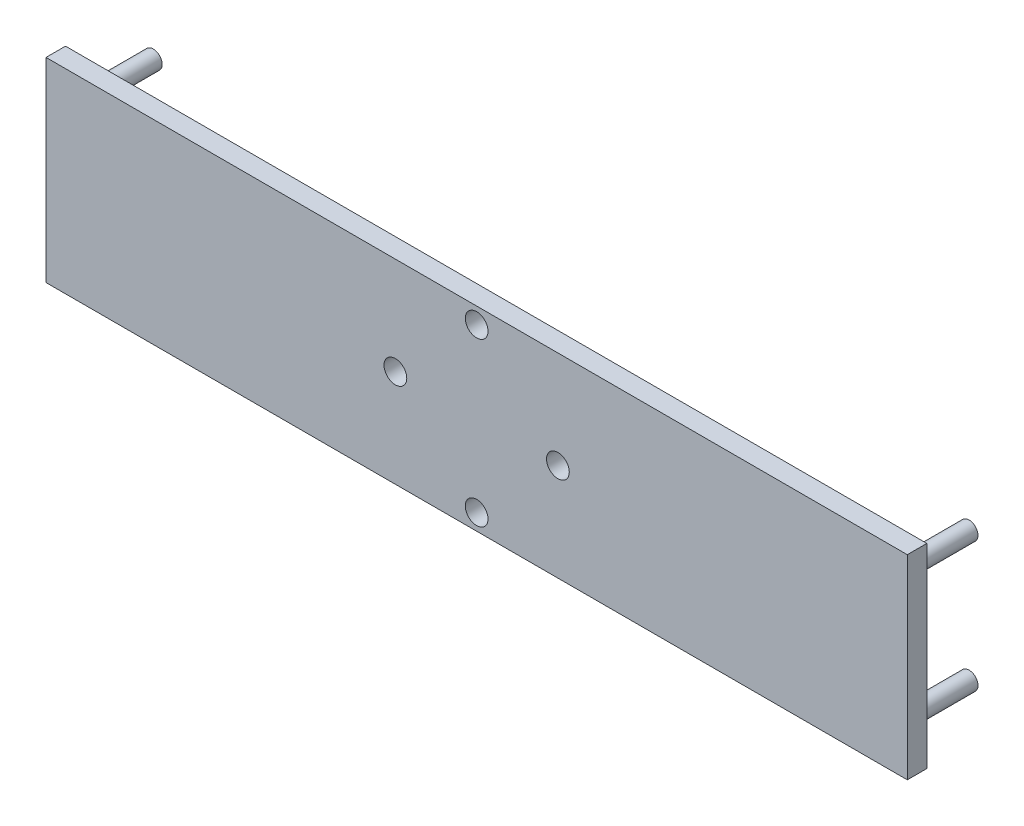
from build123d import *

# Parameters (mm, degrees)
SKETCH1_W           = 265
SKETCH1_H           = 60
SKETCH1_R           = 3.5
SKETCH1_R_2         = 2.75
BOSS_EXTRUDE1_DEPTH = 6
SKETCH1_4_R         = 2.75
BOSS_EXTRUDE2_DEPTH = 20


with BuildPart() as part:
    # Sketch1 → Boss-Extrude1 (new body)
    # profile 1 of 5: a face of its own
    with BuildSketch(Plane.XY):
        Rectangle(SKETCH1_W, SKETCH1_H)
        with Locations((-25, 0)):
            Circle(SKETCH1_R, mode=Mode.SUBTRACT)
        with Locations((0, -25)):
            Circle(SKETCH1_R, mode=Mode.SUBTRACT)
        with Locations((25, 0)):
            Circle(SKETCH1_R, mode=Mode.SUBTRACT)
        with Locations((0, 25)):
            Circle(SKETCH1_R, mode=Mode.SUBTRACT)
        with Locations((-125.5, -20)):
            Circle(SKETCH1_R_2, mode=Mode.SUBTRACT)
        with Locations((-125.5, 20)):
            Circle(SKETCH1_R_2, mode=Mode.SUBTRACT)
        with Locations((125.5, -20)):
            Circle(SKETCH1_R_2, mode=Mode.SUBTRACT)
        with Locations((125.5, 20)):
            Circle(SKETCH1_R_2, mode=Mode.SUBTRACT)
    # profile 2 of 5: a face of its own
    with BuildSketch(Plane.XY):
        with Locations((125.5, -20)):
            Circle(SKETCH1_R_2)
    # profile 3 of 5: a face of its own
    with BuildSketch(Plane.XY):
        with Locations((125.5, 20)):
            Circle(SKETCH1_R_2)
    # profile 4 of 5: a face of its own
    with BuildSketch(Plane.XY):
        with Locations((-125.5, -20)):
            Circle(SKETCH1_R_2)
    # profile 5 of 5: a face of its own
    with BuildSketch(Plane.XY):
        with Locations((-125.5, 20)):
            Circle(SKETCH1_R_2)
    extrude(amount=BOSS_EXTRUDE1_DEPTH)

    # Sketch1_4 → Boss-Extrude2 (add)
    with BuildSketch(Plane.XY):
        with Locations((-125.5, 20)):
            Circle(SKETCH1_4_R)
        with Locations((-125.5, -20)):
            Circle(SKETCH1_4_R)
        with Locations((125.5, -20)):
            Circle(SKETCH1_4_R)
        with Locations((125.5, 20)):
            Circle(SKETCH1_4_R)
    extrude(amount=-BOSS_EXTRUDE2_DEPTH)


solid = part.part
